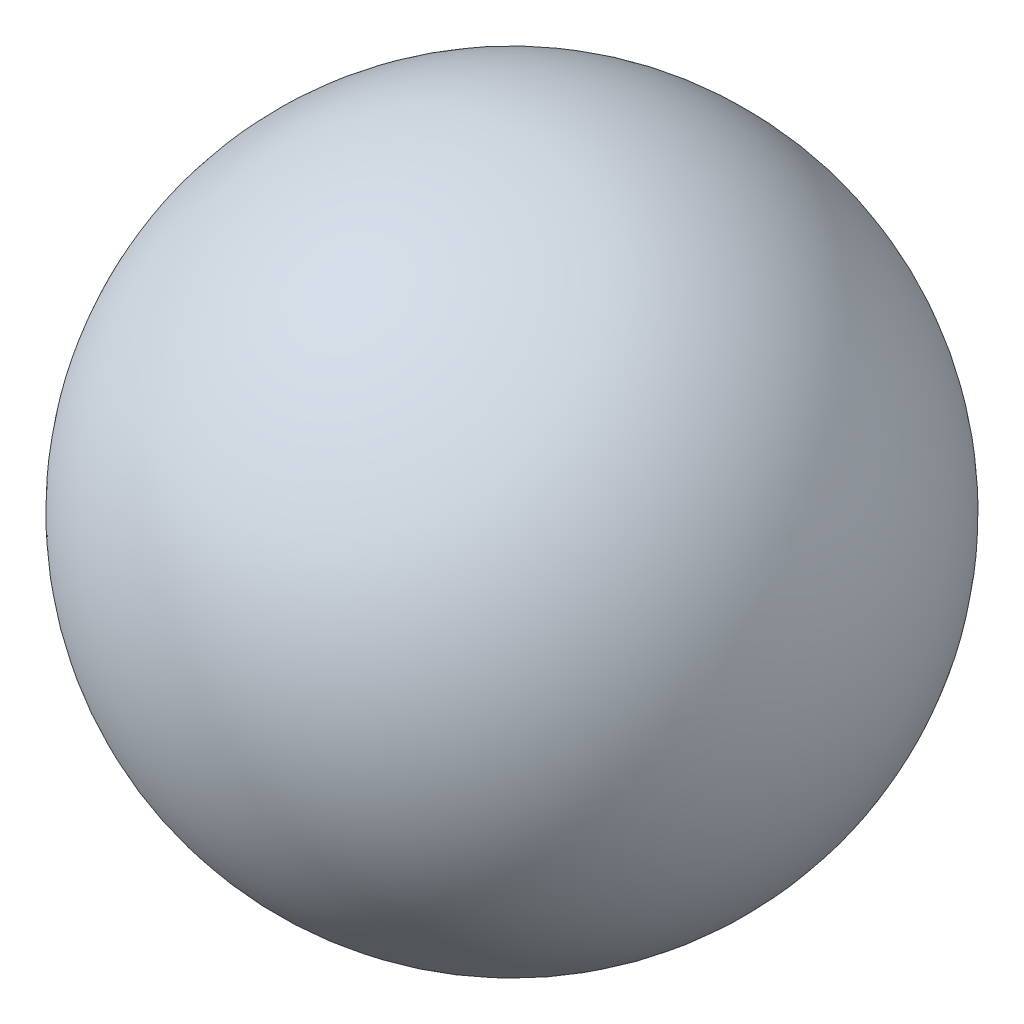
from build123d import *


with BuildPart() as part:
    # Esquisse1 → Base-R_volution (revolve)
    with BuildSketch(Plane.XY):
        with BuildLine():
            Line((-2.25, 0), (2.25, 0))
            ThreePointArc((2.25, 0), (0, -2.25), (-2.25, 0))
        make_face()
    revolve(axis=Axis((-10, 0, 0), (1, 0, 0)))


solid = part.part
